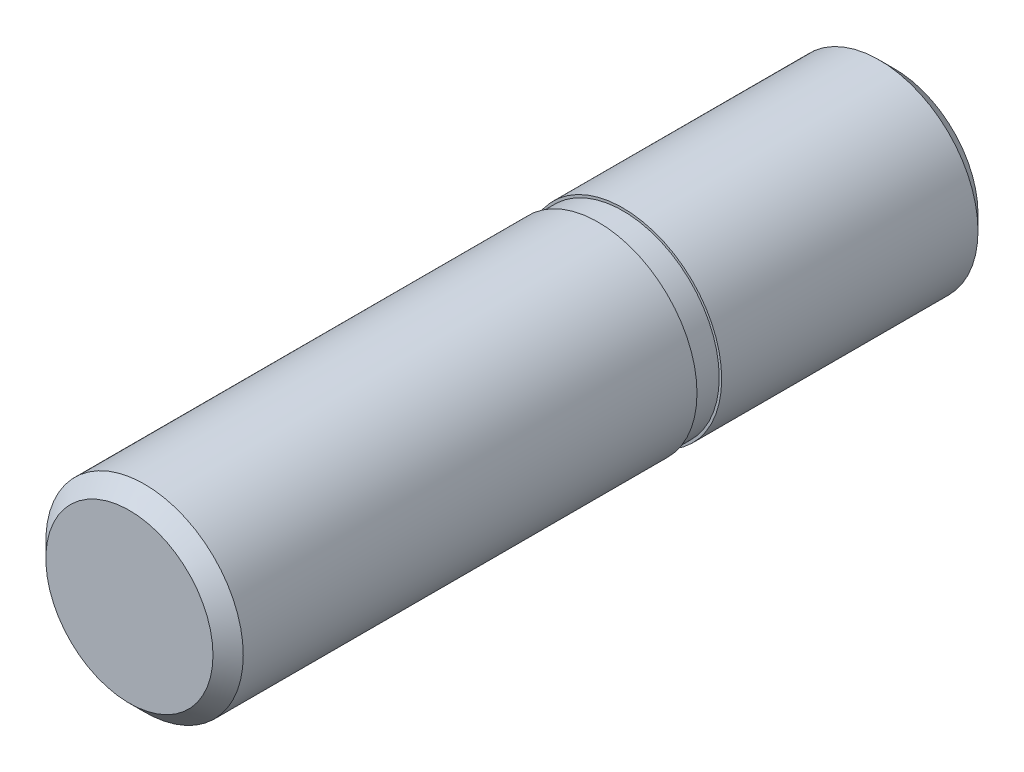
ISO-10303-21;
HEADER;
FILE_DESCRIPTION(('STEP AP214'),'2;1');
FILE_NAME('part.step','',(''),(''),'','','');
FILE_SCHEMA(('AUTOMOTIVE_DESIGN { 1 0 10303 214 1 1 1 1 }'));
ENDSEC;
DATA;
#1=APPLICATION_CONTEXT('core data for automotive mechanical design processes');
#2=APPLICATION_PROTOCOL_DEFINITION('international standard','automotive_design',2000,#1);
#3=PRODUCT_CONTEXT('',#1,'mechanical');
#4=PRODUCT('Part','Part','',(#3));
#5=PRODUCT_RELATED_PRODUCT_CATEGORY('part','',(#4));
#6=PRODUCT_DEFINITION_FORMATION('','',#4);
#7=PRODUCT_DEFINITION_CONTEXT('part definition',#1,'design');
#8=PRODUCT_DEFINITION('design','',#6,#7);
#9=PRODUCT_DEFINITION_SHAPE('','',#8);
#10=(LENGTH_UNIT() NAMED_UNIT(*) SI_UNIT(.MILLI.,.METRE.));
#11=(NAMED_UNIT(*) PLANE_ANGLE_UNIT() SI_UNIT($,.RADIAN.));
#12=(NAMED_UNIT(*) SI_UNIT($,.STERADIAN.) SOLID_ANGLE_UNIT());
#13=UNCERTAINTY_MEASURE_WITH_UNIT(LENGTH_MEASURE(1.E-05),#10,'distance_accuracy_value','');
#14=(GEOMETRIC_REPRESENTATION_CONTEXT(3) GLOBAL_UNCERTAINTY_ASSIGNED_CONTEXT((#13)) GLOBAL_UNIT_ASSIGNED_CONTEXT((#10,
#11,#12)) REPRESENTATION_CONTEXT('',''));
#15=CARTESIAN_POINT('',(0.,0.,0.));
#16=DIRECTION('',(0.,0.,1.));
#17=DIRECTION('',(1.,0.,0.));
#18=AXIS2_PLACEMENT_3D('',#15,#16,#17);
#19=CARTESIAN_POINT('',(0.,3.3865,-22.));
#20=DIRECTION('',(0.,0.,-1.));
#21=DIRECTION('',(-1.,0.,0.));
#22=AXIS2_PLACEMENT_3D('',#19,#20,#21);
#23=PLANE('',#22);
#24=CARTESIAN_POINT('',(0.,0.,-22.));
#25=DIRECTION('',(0.,0.,1.));
#26=DIRECTION('',(1.,0.,0.));
#27=AXIS2_PLACEMENT_3D('',#24,#25,#26);
#28=CIRCLE('',#27,6.773);
#29=CARTESIAN_POINT('',(6.773,0.,-22.));
#30=VERTEX_POINT('',#29);
#31=EDGE_CURVE('E19',#30,#30,#28,.T.);
#32=ORIENTED_EDGE('',*,*,#31,.F.);
#33=EDGE_LOOP('',(#32));
#34=FACE_BOUND('',#33,.T.);
#35=ADVANCED_FACE('F12',(#34),#23,.T.);
#36=CARTESIAN_POINT('',(0.,0.,-20.773));
#37=DIRECTION('',(0.,0.,1.));
#38=DIRECTION('',(1.,0.,0.));
#39=AXIS2_PLACEMENT_3D('',#36,#37,#38);
#40=CONICAL_SURFACE('',#39,8.,0.785398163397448);
#41=CARTESIAN_POINT('',(0.,0.,-20.773));
#42=DIRECTION('',(0.,0.,1.));
#43=DIRECTION('',(1.,0.,0.));
#44=AXIS2_PLACEMENT_3D('',#41,#42,#43);
#45=CIRCLE('',#44,8.);
#46=CARTESIAN_POINT('',(8.,0.,-20.773));
#47=VERTEX_POINT('',#46);
#48=EDGE_CURVE('E23',#47,#47,#45,.T.);
#49=ORIENTED_EDGE('',*,*,#48,.F.);
#50=EDGE_LOOP('',(#49));
#51=FACE_BOUND('',#50,.T.);
#52=ORIENTED_EDGE('',*,*,#31,.T.);
#53=EDGE_LOOP('',(#52));
#54=FACE_BOUND('',#53,.T.);
#55=ADVANCED_FACE('F66',(#51,#54),#40,.T.);
#56=CARTESIAN_POINT('',(0.,0.,5.));
#57=DIRECTION('',(0.,0.,1.));
#58=DIRECTION('',(1.,0.,0.));
#59=AXIS2_PLACEMENT_3D('',#56,#57,#58);
#60=CYLINDRICAL_SURFACE('',#59,8.);
#61=CARTESIAN_POINT('',(0.,0.,0.));
#62=DIRECTION('',(0.,0.,1.));
#63=DIRECTION('',(1.,0.,0.));
#64=AXIS2_PLACEMENT_3D('',#61,#62,#63);
#65=CIRCLE('',#64,8.);
#66=CARTESIAN_POINT('',(8.,0.,0.));
#67=VERTEX_POINT('',#66);
#68=EDGE_CURVE('E28',#67,#67,#65,.T.);
#69=ORIENTED_EDGE('',*,*,#68,.F.);
#70=EDGE_LOOP('',(#69));
#71=FACE_BOUND('',#70,.T.);
#72=ORIENTED_EDGE('',*,*,#48,.T.);
#73=EDGE_LOOP('',(#72));
#74=FACE_BOUND('',#73,.T.);
#75=ADVANCED_FACE('F72',(#71,#74),#60,.T.);
#76=CARTESIAN_POINT('',(0.,0.,0.));
#77=DIRECTION('',(0.,0.,1.));
#78=DIRECTION('',(1.,0.,0.));
#79=AXIS2_PLACEMENT_3D('',#76,#77,#78);
#80=PLANE('',#79);
#81=CARTESIAN_POINT('',(0.,0.,0.));
#82=DIRECTION('',(0.,0.,1.));
#83=DIRECTION('',(1.,0.,0.));
#84=AXIS2_PLACEMENT_3D('',#81,#82,#83);
#85=CIRCLE('',#84,7.8);
#86=CARTESIAN_POINT('',(7.8,0.,0.));
#87=VERTEX_POINT('',#86);
#88=EDGE_CURVE('E8',#87,#87,#85,.T.);
#89=ORIENTED_EDGE('',*,*,#88,.F.);
#90=EDGE_LOOP('',(#89));
#91=FACE_BOUND('',#90,.T.);
#92=ORIENTED_EDGE('',*,*,#68,.T.);
#93=EDGE_LOOP('',(#92));
#94=FACE_BOUND('',#93,.T.);
#95=ADVANCED_FACE('F77',(#91,#94),#80,.T.);
#96=CARTESIAN_POINT('',(0.,0.,-4.58554746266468));
#97=DIRECTION('',(0.,0.,-1.));
#98=DIRECTION('',(-1.,0.,0.));
#99=AXIS2_PLACEMENT_3D('',#96,#97,#98);
#100=CYLINDRICAL_SURFACE('',#99,7.8);
#101=CARTESIAN_POINT('',(0.,0.,2.));
#102=DIRECTION('',(0.,0.,-1.));
#103=DIRECTION('',(-1.,0.,0.));
#104=AXIS2_PLACEMENT_3D('',#101,#102,#103);
#105=CIRCLE('',#104,7.8);
#106=CARTESIAN_POINT('',(-7.8,0.,2.));
#107=VERTEX_POINT('',#106);
#108=EDGE_CURVE('E44',#107,#107,#105,.T.);
#109=ORIENTED_EDGE('',*,*,#108,.T.);
#110=EDGE_LOOP('',(#109));
#111=FACE_BOUND('',#110,.T.);
#112=ORIENTED_EDGE('',*,*,#88,.T.);
#113=EDGE_LOOP('',(#112));
#114=FACE_BOUND('',#113,.T.);
#115=ADVANCED_FACE('F51',(#111,#114),#100,.T.);
#116=CARTESIAN_POINT('',(0.,0.,40.));
#117=DIRECTION('',(0.,0.,1.));
#118=DIRECTION('',(1.,0.,0.));
#119=AXIS2_PLACEMENT_3D('',#116,#117,#118);
#120=PLANE('',#119);
#121=CARTESIAN_POINT('',(0.,0.,40.));
#122=DIRECTION('',(0.,0.,1.));
#123=DIRECTION('',(1.,0.,0.));
#124=AXIS2_PLACEMENT_3D('',#121,#122,#123);
#125=CIRCLE('',#124,6.773);
#126=CARTESIAN_POINT('',(6.773,0.,40.));
#127=VERTEX_POINT('',#126);
#128=EDGE_CURVE('E40',#127,#127,#125,.T.);
#129=ORIENTED_EDGE('',*,*,#128,.T.);
#130=EDGE_LOOP('',(#129));
#131=FACE_BOUND('',#130,.T.);
#132=ADVANCED_FACE('F85',(#131),#120,.T.);
#133=CARTESIAN_POINT('',(0.,0.,40.));
#134=DIRECTION('',(0.,0.,-1.));
#135=DIRECTION('',(-1.,0.,0.));
#136=AXIS2_PLACEMENT_3D('',#133,#134,#135);
#137=CONICAL_SURFACE('',#136,6.773,0.785398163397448);
#138=CARTESIAN_POINT('',(0.,0.,38.773));
#139=DIRECTION('',(0.,0.,1.));
#140=DIRECTION('',(1.,0.,0.));
#141=AXIS2_PLACEMENT_3D('',#138,#139,#140);
#142=CIRCLE('',#141,8.);
#143=CARTESIAN_POINT('',(8.,0.,38.773));
#144=VERTEX_POINT('',#143);
#145=EDGE_CURVE('E31',#144,#144,#142,.F.);
#146=ORIENTED_EDGE('',*,*,#145,.F.);
#147=EDGE_LOOP('',(#146));
#148=FACE_BOUND('',#147,.T.);
#149=ORIENTED_EDGE('',*,*,#128,.F.);
#150=EDGE_LOOP('',(#149));
#151=FACE_BOUND('',#150,.T.);
#152=ADVANCED_FACE('F62',(#148,#151),#137,.T.);
#153=CARTESIAN_POINT('',(0.,0.,5.));
#154=DIRECTION('',(0.,0.,1.));
#155=DIRECTION('',(1.,0.,0.));
#156=AXIS2_PLACEMENT_3D('',#153,#154,#155);
#157=CYLINDRICAL_SURFACE('',#156,8.);
#158=CARTESIAN_POINT('',(0.,0.,2.));
#159=DIRECTION('',(0.,0.,1.));
#160=DIRECTION('',(1.,0.,0.));
#161=AXIS2_PLACEMENT_3D('',#158,#159,#160);
#162=CIRCLE('',#161,8.);
#163=CARTESIAN_POINT('',(8.,0.,2.));
#164=VERTEX_POINT('',#163);
#165=EDGE_CURVE('E35',#164,#164,#162,.T.);
#166=ORIENTED_EDGE('',*,*,#165,.T.);
#167=EDGE_LOOP('',(#166));
#168=FACE_BOUND('',#167,.T.);
#169=ORIENTED_EDGE('',*,*,#145,.T.);
#170=EDGE_LOOP('',(#169));
#171=FACE_BOUND('',#170,.T.);
#172=ADVANCED_FACE('F14',(#168,#171),#157,.T.);
#173=CARTESIAN_POINT('',(0.,0.,2.));
#174=DIRECTION('',(0.,0.,1.));
#175=DIRECTION('',(1.,0.,0.));
#176=AXIS2_PLACEMENT_3D('',#173,#174,#175);
#177=PLANE('',#176);
#178=ORIENTED_EDGE('',*,*,#108,.F.);
#179=EDGE_LOOP('',(#178));
#180=FACE_BOUND('',#179,.T.);
#181=ORIENTED_EDGE('',*,*,#165,.F.);
#182=EDGE_LOOP('',(#181));
#183=FACE_BOUND('',#182,.T.);
#184=ADVANCED_FACE('F53',(#180,#183),#177,.F.);
#185=CLOSED_SHELL('',(#35,#55,#75,#95,#115,#132,#152,#172,#184));
#186=MANIFOLD_SOLID_BREP('B1',#185);
#187=ADVANCED_BREP_SHAPE_REPRESENTATION('',(#18,#186),#14);
#188=SHAPE_DEFINITION_REPRESENTATION(#9,#187);
ENDSEC;
END-ISO-10303-21;
